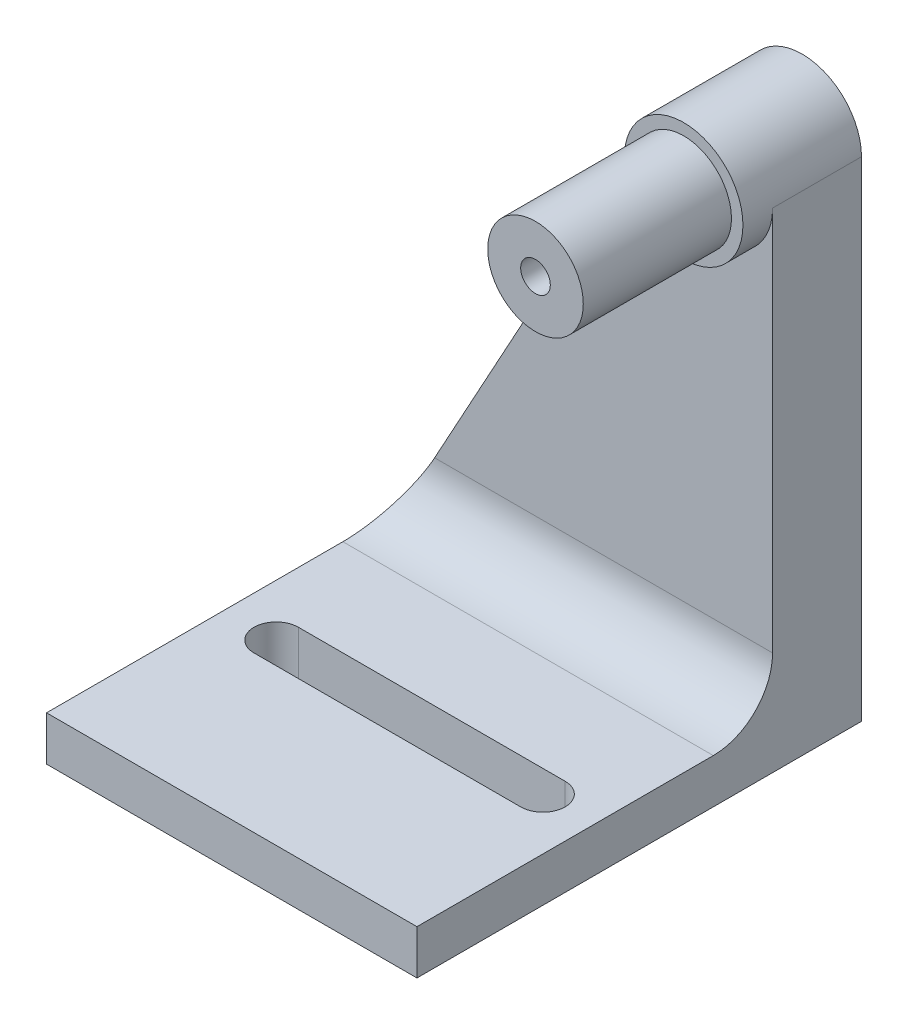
from build123d import *

# Parameters (mm, degrees)
ESQUISSE1_W             = 25
ESQUISSE1_H             = 3
BOSS_EXTRU_1_DEPTH      = 6
ESQUISSE2_R             = 4
BOSS_EXTRU_2_DEPTH      = 2
ESQUISSE3_R             = 3.225
BOSS_EXTRU_3_DEPTH      = 10
ESQUISSE4_W             = 25
ESQUISSE4_H             = 3
BOSS_EXTRU_4_DEPTH      = 30
ESQUISSE5_R             = 1
ENL_V_MAT_EXTRU_1_DEPTH = 32
ENL_V_MAT_EXTRU_2_DEPTH = 32
CONG_1_R                = 4


with BuildPart() as part:
    # Esquisse1 → Boss.-Extru.1 (new body)
    with BuildSketch(Plane.XY):
        with BuildLine():
            Line((0, 0), (0, 30))
            ThreePointArc((0, 30), (-3.007910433, 33.875017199), (-7.507879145, 31.922182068))
            Line((-7.507879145, 31.922182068), (-25, 0))
            Line((-25, 0), (0, 0))
        make_face()
        with Locations((-12.5, -1.5)):
            Rectangle(ESQUISSE1_W, ESQUISSE1_H)
    extrude(amount=BOSS_EXTRU_1_DEPTH)

    # Esquisse2 → Boss.-Extru.2 (add)
    with BuildSketch(Plane.XY.offset(6)):
        with Locations((-4, 30)):
            Circle(ESQUISSE2_R)
    extrude(amount=BOSS_EXTRU_2_DEPTH)

    # Esquisse3 → Boss.-Extru.3 (add)
    with BuildSketch(Plane.XY.offset(8)):
        with Locations((-4, 30)):
            Circle(ESQUISSE3_R)
    extrude(amount=BOSS_EXTRU_3_DEPTH)

    # Esquisse4 → Boss.-Extru.4 (add)
    with BuildSketch(Plane(origin=(0, 0, 0), x_dir=(-1, 0, 0), z_dir=(0, 0, -1))):
        with Locations((12.5, -1.5)):
            Rectangle(ESQUISSE4_W, ESQUISSE4_H)
    extrude(amount=-BOSS_EXTRU_4_DEPTH)

    # Esquisse5 → Enl_v. mat.-Extru.1 (cut)
    with BuildSketch(Plane.XY.offset(18)):
        with Locations((-4, 30)):
            Circle(ESQUISSE5_R)
    extrude(amount=-ENL_V_MAT_EXTRU_1_DEPTH, mode=Mode.SUBTRACT)

    # Esquisse6 → Enl_v. mat.-Extru.2 (cut)
    with BuildSketch(Plane(origin=(0, 0, 0), x_dir=(1, 0, 0), z_dir=(0, 1, 0))):
        with BuildLine():
            Line((-21.5, -16.5), (-3.5, -16.5))
            ThreePointArc((-3.5, -16.5), (-2, -18), (-3.5, -19.5))
            Line((-3.5, -19.5), (-21.5, -19.5))
            ThreePointArc((-21.5, -19.5), (-23, -18), (-21.5, -16.5))
        make_face()
    extrude(amount=-ENL_V_MAT_EXTRU_2_DEPTH, mode=Mode.SUBTRACT)

    # Cong_1
    cong_1_edges = [part.edges().sort_by_distance(p)[0] for p in [
        (-12.5, 0, 6),
    ]]
    fillet(cong_1_edges, radius=CONG_1_R)


solid = part.part
